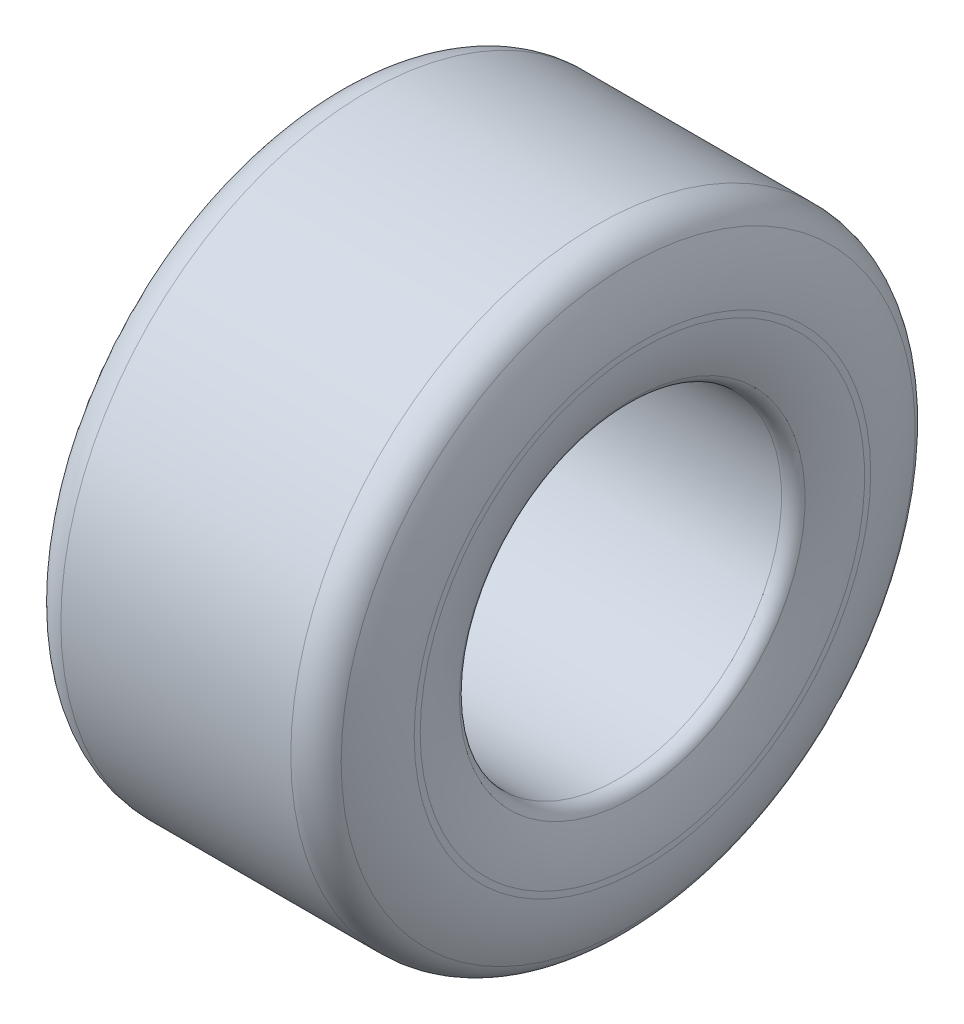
ISO-10303-21;
HEADER;
FILE_DESCRIPTION(('STEP AP214'),'2;1');
FILE_NAME('part.step','',(''),(''),'','','');
FILE_SCHEMA(('AUTOMOTIVE_DESIGN { 1 0 10303 214 1 1 1 1 }'));
ENDSEC;
DATA;
#1=APPLICATION_CONTEXT('core data for automotive mechanical design processes');
#2=APPLICATION_PROTOCOL_DEFINITION('international standard','automotive_design',2000,#1);
#3=PRODUCT_CONTEXT('',#1,'mechanical');
#4=PRODUCT('Part','Part','',(#3));
#5=PRODUCT_RELATED_PRODUCT_CATEGORY('part','',(#4));
#6=PRODUCT_DEFINITION_FORMATION('','',#4);
#7=PRODUCT_DEFINITION_CONTEXT('part definition',#1,'design');
#8=PRODUCT_DEFINITION('design','',#6,#7);
#9=PRODUCT_DEFINITION_SHAPE('','',#8);
#10=(LENGTH_UNIT() NAMED_UNIT(*) SI_UNIT(.MILLI.,.METRE.));
#11=(NAMED_UNIT(*) PLANE_ANGLE_UNIT() SI_UNIT($,.RADIAN.));
#12=(NAMED_UNIT(*) SI_UNIT($,.STERADIAN.) SOLID_ANGLE_UNIT());
#13=UNCERTAINTY_MEASURE_WITH_UNIT(LENGTH_MEASURE(1.E-05),#10,'distance_accuracy_value','');
#14=(GEOMETRIC_REPRESENTATION_CONTEXT(3) GLOBAL_UNCERTAINTY_ASSIGNED_CONTEXT((#13)) GLOBAL_UNIT_ASSIGNED_CONTEXT((#10,
#11,#12)) REPRESENTATION_CONTEXT('',''));
#15=CARTESIAN_POINT('',(0.,0.,0.));
#16=DIRECTION('',(0.,0.,1.));
#17=DIRECTION('',(1.,0.,0.));
#18=AXIS2_PLACEMENT_3D('',#15,#16,#17);
#19=CARTESIAN_POINT('',(-57.15,0.,0.));
#20=DIRECTION('',(-1.,0.,0.));
#21=DIRECTION('',(0.,0.,1.));
#22=AXIS2_PLACEMENT_3D('',#19,#20,#21);
#23=TOROIDAL_SURFACE('',#22,74.93,6.35);
#24=CARTESIAN_POINT('',(-57.15,0.,0.));
#25=DIRECTION('',(-1.,0.,0.));
#26=DIRECTION('',(0.,0.,1.));
#27=AXIS2_PLACEMENT_3D('',#24,#25,#26);
#28=CIRCLE('',#27,68.58);
#29=CARTESIAN_POINT('',(-57.15,0.,68.58));
#30=VERTEX_POINT('',#29);
#31=EDGE_CURVE('E73',#30,#30,#28,.T.);
#32=ORIENTED_EDGE('',*,*,#31,.F.);
#33=EDGE_LOOP('',(#32));
#34=FACE_BOUND('',#33,.T.);
#35=CARTESIAN_POINT('',(-63.0360519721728,0.,0.));
#36=DIRECTION('',(-1.,0.,0.));
#37=DIRECTION('',(0.,0.,1.));
#38=AXIS2_PLACEMENT_3D('',#35,#36,#37);
#39=CIRCLE('',#38,72.5473770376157);
#40=CARTESIAN_POINT('',(-63.0360519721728,0.,72.5473770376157));
#41=VERTEX_POINT('',#40);
#42=EDGE_CURVE('E10',#41,#41,#39,.T.);
#43=ORIENTED_EDGE('',*,*,#42,.T.);
#44=EDGE_LOOP('',(#43));
#45=FACE_BOUND('',#44,.T.);
#46=ADVANCED_FACE('F33',(#34,#45),#23,.T.);
#47=CARTESIAN_POINT('',(-8.63863195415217,0.,0.));
#48=DIRECTION('',(-1.,0.,0.));
#49=DIRECTION('',(0.,0.,1.));
#50=AXIS2_PLACEMENT_3D('',#47,#48,#49);
#51=TOROIDAL_SURFACE('',#50,94.566982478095,58.6851116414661);
#52=ORIENTED_EDGE('',*,*,#42,.F.);
#53=EDGE_LOOP('',(#52));
#54=FACE_BOUND('',#53,.T.);
#55=CARTESIAN_POINT('',(-67.31,0.,0.));
#56=DIRECTION('',(-1.,0.,0.));
#57=DIRECTION('',(0.,0.,1.));
#58=AXIS2_PLACEMENT_3D('',#55,#56,#57);
#59=CIRCLE('',#58,93.296982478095);
#60=CARTESIAN_POINT('',(-67.31,0.,93.296982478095));
#61=VERTEX_POINT('',#60);
#62=EDGE_CURVE('E39',#61,#61,#59,.T.);
#63=ORIENTED_EDGE('',*,*,#62,.T.);
#64=EDGE_LOOP('',(#63));
#65=FACE_BOUND('',#64,.T.);
#66=ADVANCED_FACE('F80',(#54,#65),#51,.T.);
#67=CARTESIAN_POINT('',(-67.31,93.296982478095,0.));
#68=DIRECTION('',(1.,0.,0.));
#69=DIRECTION('',(0.,0.,-1.));
#70=AXIS2_PLACEMENT_3D('',#67,#68,#69);
#71=PLANE('',#70);
#72=ORIENTED_EDGE('',*,*,#62,.F.);
#73=EDGE_LOOP('',(#72));
#74=FACE_BOUND('',#73,.T.);
#75=CARTESIAN_POINT('',(-67.31,0.,0.));
#76=DIRECTION('',(-1.,0.,0.));
#77=DIRECTION('',(0.,0.,1.));
#78=AXIS2_PLACEMENT_3D('',#75,#76,#77);
#79=CIRCLE('',#78,95.836982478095);
#80=CARTESIAN_POINT('',(-67.31,0.,95.836982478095));
#81=VERTEX_POINT('',#80);
#82=EDGE_CURVE('E43',#81,#81,#79,.T.);
#83=ORIENTED_EDGE('',*,*,#82,.T.);
#84=EDGE_LOOP('',(#83));
#85=FACE_BOUND('',#84,.T.);
#86=ADVANCED_FACE('F84',(#74,#85),#71,.F.);
#87=CARTESIAN_POINT('',(-8.63863195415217,0.,0.));
#88=DIRECTION('',(-1.,0.,0.));
#89=DIRECTION('',(0.,0.,1.));
#90=AXIS2_PLACEMENT_3D('',#87,#88,#89);
#91=TOROIDAL_SURFACE('',#90,94.566982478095,58.685111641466);
#92=ORIENTED_EDGE('',*,*,#82,.F.);
#93=EDGE_LOOP('',(#92));
#94=FACE_BOUND('',#93,.T.);
#95=CARTESIAN_POINT('',(-61.2966624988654,0.,0.));
#96=DIRECTION('',(-1.,0.,0.));
#97=DIRECTION('',(0.,0.,1.));
#98=AXIS2_PLACEMENT_3D('',#95,#96,#97);
#99=CIRCLE('',#98,120.472081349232);
#100=CARTESIAN_POINT('',(-61.2966624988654,0.,120.472081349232));
#101=VERTEX_POINT('',#100);
#102=EDGE_CURVE('E47',#101,#101,#99,.T.);
#103=ORIENTED_EDGE('',*,*,#102,.T.);
#104=EDGE_LOOP('',(#103));
#105=FACE_BOUND('',#104,.T.);
#106=ADVANCED_FACE('F89',(#94,#105),#91,.T.);
#107=CARTESIAN_POINT('',(-48.26,0.,0.));
#108=DIRECTION('',(-1.,0.,0.));
#109=DIRECTION('',(0.,0.,1.));
#110=AXIS2_PLACEMENT_3D('',#107,#108,#109);
#111=TOROIDAL_SURFACE('',#110,114.0587,14.5288);
#112=ORIENTED_EDGE('',*,*,#102,.F.);
#113=EDGE_LOOP('',(#112));
#114=FACE_BOUND('',#113,.T.);
#115=CARTESIAN_POINT('',(-48.26,0.,0.));
#116=DIRECTION('',(-1.,0.,0.));
#117=DIRECTION('',(0.,0.,1.));
#118=AXIS2_PLACEMENT_3D('',#115,#116,#117);
#119=CIRCLE('',#118,128.5875);
#120=CARTESIAN_POINT('',(-48.26,0.,128.5875));
#121=VERTEX_POINT('',#120);
#122=EDGE_CURVE('E52',#121,#121,#119,.T.);
#123=ORIENTED_EDGE('',*,*,#122,.T.);
#124=EDGE_LOOP('',(#123));
#125=FACE_BOUND('',#124,.T.);
#126=ADVANCED_FACE('F95',(#114,#125),#111,.T.);
#127=CARTESIAN_POINT('',(0.,0.,0.));
#128=DIRECTION('',(-1.,0.,0.));
#129=DIRECTION('',(0.,0.,1.));
#130=AXIS2_PLACEMENT_3D('',#127,#128,#129);
#131=CYLINDRICAL_SURFACE('',#130,128.5875);
#132=ORIENTED_EDGE('',*,*,#122,.F.);
#133=EDGE_LOOP('',(#132));
#134=FACE_BOUND('',#133,.T.);
#135=CARTESIAN_POINT('',(48.26,0.,0.));
#136=DIRECTION('',(-1.,0.,0.));
#137=DIRECTION('',(0.,0.,1.));
#138=AXIS2_PLACEMENT_3D('',#135,#136,#137);
#139=CIRCLE('',#138,128.5875);
#140=CARTESIAN_POINT('',(48.26,0.,128.5875));
#141=VERTEX_POINT('',#140);
#142=EDGE_CURVE('E55',#141,#141,#139,.T.);
#143=ORIENTED_EDGE('',*,*,#142,.T.);
#144=EDGE_LOOP('',(#143));
#145=FACE_BOUND('',#144,.T.);
#146=ADVANCED_FACE('F99',(#134,#145),#131,.T.);
#147=CARTESIAN_POINT('',(48.26,0.,0.));
#148=DIRECTION('',(-1.,0.,0.));
#149=DIRECTION('',(0.,0.,1.));
#150=AXIS2_PLACEMENT_3D('',#147,#148,#149);
#151=TOROIDAL_SURFACE('',#150,114.0587,14.5288);
#152=ORIENTED_EDGE('',*,*,#142,.F.);
#153=EDGE_LOOP('',(#152));
#154=FACE_BOUND('',#153,.T.);
#155=CARTESIAN_POINT('',(61.2966624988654,0.,0.));
#156=DIRECTION('',(-1.,0.,0.));
#157=DIRECTION('',(0.,0.,1.));
#158=AXIS2_PLACEMENT_3D('',#155,#156,#157);
#159=CIRCLE('',#158,120.472081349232);
#160=CARTESIAN_POINT('',(61.2966624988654,0.,120.472081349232));
#161=VERTEX_POINT('',#160);
#162=EDGE_CURVE('E58',#161,#161,#159,.T.);
#163=ORIENTED_EDGE('',*,*,#162,.T.);
#164=EDGE_LOOP('',(#163));
#165=FACE_BOUND('',#164,.T.);
#166=ADVANCED_FACE('F103',(#154,#165),#151,.T.);
#167=CARTESIAN_POINT('',(8.63863195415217,0.,0.));
#168=DIRECTION('',(-1.,0.,0.));
#169=DIRECTION('',(0.,0.,1.));
#170=AXIS2_PLACEMENT_3D('',#167,#168,#169);
#171=TOROIDAL_SURFACE('',#170,94.566982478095,58.685111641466);
#172=ORIENTED_EDGE('',*,*,#162,.F.);
#173=EDGE_LOOP('',(#172));
#174=FACE_BOUND('',#173,.T.);
#175=CARTESIAN_POINT('',(67.31,0.,0.));
#176=DIRECTION('',(-1.,0.,0.));
#177=DIRECTION('',(0.,0.,1.));
#178=AXIS2_PLACEMENT_3D('',#175,#176,#177);
#179=CIRCLE('',#178,95.836982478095);
#180=CARTESIAN_POINT('',(67.31,0.,95.836982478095));
#181=VERTEX_POINT('',#180);
#182=EDGE_CURVE('E61',#181,#181,#179,.T.);
#183=ORIENTED_EDGE('',*,*,#182,.T.);
#184=EDGE_LOOP('',(#183));
#185=FACE_BOUND('',#184,.T.);
#186=ADVANCED_FACE('F107',(#174,#185),#171,.T.);
#187=CARTESIAN_POINT('',(67.31,93.296982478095,0.));
#188=DIRECTION('',(-1.,0.,0.));
#189=DIRECTION('',(0.,0.,1.));
#190=AXIS2_PLACEMENT_3D('',#187,#188,#189);
#191=PLANE('',#190);
#192=ORIENTED_EDGE('',*,*,#182,.F.);
#193=EDGE_LOOP('',(#192));
#194=FACE_BOUND('',#193,.T.);
#195=CARTESIAN_POINT('',(67.31,0.,0.));
#196=DIRECTION('',(-1.,0.,0.));
#197=DIRECTION('',(0.,0.,1.));
#198=AXIS2_PLACEMENT_3D('',#195,#196,#197);
#199=CIRCLE('',#198,93.2969824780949);
#200=CARTESIAN_POINT('',(67.31,0.,93.2969824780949));
#201=VERTEX_POINT('',#200);
#202=EDGE_CURVE('E64',#201,#201,#199,.T.);
#203=ORIENTED_EDGE('',*,*,#202,.T.);
#204=EDGE_LOOP('',(#203));
#205=FACE_BOUND('',#204,.T.);
#206=ADVANCED_FACE('F111',(#194,#205),#191,.F.);
#207=CARTESIAN_POINT('',(8.63863195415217,0.,0.));
#208=DIRECTION('',(-1.,0.,0.));
#209=DIRECTION('',(0.,0.,1.));
#210=AXIS2_PLACEMENT_3D('',#207,#208,#209);
#211=TOROIDAL_SURFACE('',#210,94.566982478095,58.6851116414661);
#212=ORIENTED_EDGE('',*,*,#202,.F.);
#213=EDGE_LOOP('',(#212));
#214=FACE_BOUND('',#213,.T.);
#215=CARTESIAN_POINT('',(63.0360519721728,0.,0.));
#216=DIRECTION('',(-1.,0.,0.));
#217=DIRECTION('',(0.,0.,1.));
#218=AXIS2_PLACEMENT_3D('',#215,#216,#217);
#219=CIRCLE('',#218,72.5473770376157);
#220=CARTESIAN_POINT('',(63.0360519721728,0.,72.5473770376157));
#221=VERTEX_POINT('',#220);
#222=EDGE_CURVE('E67',#221,#221,#219,.T.);
#223=ORIENTED_EDGE('',*,*,#222,.T.);
#224=EDGE_LOOP('',(#223));
#225=FACE_BOUND('',#224,.T.);
#226=ADVANCED_FACE('F115',(#214,#225),#211,.T.);
#227=CARTESIAN_POINT('',(57.15,0.,0.));
#228=DIRECTION('',(-1.,0.,0.));
#229=DIRECTION('',(0.,0.,1.));
#230=AXIS2_PLACEMENT_3D('',#227,#228,#229);
#231=TOROIDAL_SURFACE('',#230,74.93,6.35);
#232=ORIENTED_EDGE('',*,*,#222,.F.);
#233=EDGE_LOOP('',(#232));
#234=FACE_BOUND('',#233,.T.);
#235=CARTESIAN_POINT('',(57.15,0.,0.));
#236=DIRECTION('',(-1.,0.,0.));
#237=DIRECTION('',(0.,0.,1.));
#238=AXIS2_PLACEMENT_3D('',#235,#236,#237);
#239=CIRCLE('',#238,68.58);
#240=CARTESIAN_POINT('',(57.15,0.,68.58));
#241=VERTEX_POINT('',#240);
#242=EDGE_CURVE('E70',#241,#241,#239,.T.);
#243=ORIENTED_EDGE('',*,*,#242,.T.);
#244=EDGE_LOOP('',(#243));
#245=FACE_BOUND('',#244,.T.);
#246=ADVANCED_FACE('F119',(#234,#245),#231,.T.);
#247=CARTESIAN_POINT('',(0.,0.,0.));
#248=DIRECTION('',(-1.,0.,0.));
#249=DIRECTION('',(0.,0.,1.));
#250=AXIS2_PLACEMENT_3D('',#247,#248,#249);
#251=CYLINDRICAL_SURFACE('',#250,68.58);
#252=ORIENTED_EDGE('',*,*,#242,.F.);
#253=EDGE_LOOP('',(#252));
#254=FACE_BOUND('',#253,.T.);
#255=ORIENTED_EDGE('',*,*,#31,.T.);
#256=EDGE_LOOP('',(#255));
#257=FACE_BOUND('',#256,.T.);
#258=ADVANCED_FACE('F77',(#254,#257),#251,.F.);
#259=CLOSED_SHELL('',(#46,#66,#86,#106,#126,#146,#166,#186,#206,#226,#246,#258));
#260=MANIFOLD_SOLID_BREP('B2',#259);
#261=ADVANCED_BREP_SHAPE_REPRESENTATION('',(#18,#260),#14);
#262=SHAPE_DEFINITION_REPRESENTATION(#9,#261);
ENDSEC;
END-ISO-10303-21;
